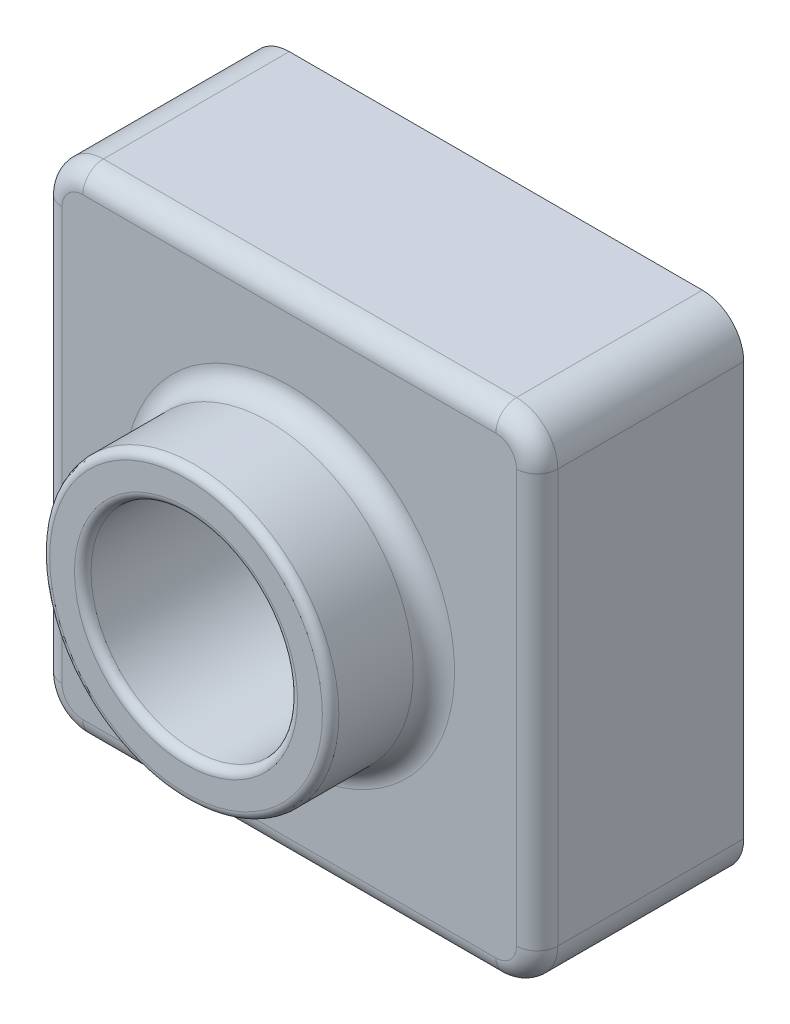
ISO-10303-21;
HEADER;
FILE_DESCRIPTION(('STEP AP214'),'2;1');
FILE_NAME('part.step','',(''),(''),'','','');
FILE_SCHEMA(('AUTOMOTIVE_DESIGN { 1 0 10303 214 1 1 1 1 }'));
ENDSEC;
DATA;
#1=APPLICATION_CONTEXT('core data for automotive mechanical design processes');
#2=APPLICATION_PROTOCOL_DEFINITION('international standard','automotive_design',2000,#1);
#3=PRODUCT_CONTEXT('',#1,'mechanical');
#4=PRODUCT('Part','Part','',(#3));
#5=PRODUCT_RELATED_PRODUCT_CATEGORY('part','',(#4));
#6=PRODUCT_DEFINITION_FORMATION('','',#4);
#7=PRODUCT_DEFINITION_CONTEXT('part definition',#1,'design');
#8=PRODUCT_DEFINITION('design','',#6,#7);
#9=PRODUCT_DEFINITION_SHAPE('','',#8);
#10=(LENGTH_UNIT() NAMED_UNIT(*) SI_UNIT(.MILLI.,.METRE.));
#11=(NAMED_UNIT(*) PLANE_ANGLE_UNIT() SI_UNIT($,.RADIAN.));
#12=(NAMED_UNIT(*) SI_UNIT($,.STERADIAN.) SOLID_ANGLE_UNIT());
#13=UNCERTAINTY_MEASURE_WITH_UNIT(LENGTH_MEASURE(1.E-05),#10,'distance_accuracy_value','');
#14=(GEOMETRIC_REPRESENTATION_CONTEXT(3) GLOBAL_UNCERTAINTY_ASSIGNED_CONTEXT((#13)) GLOBAL_UNIT_ASSIGNED_CONTEXT((#10,
#11,#12)) REPRESENTATION_CONTEXT('',''));
#15=CARTESIAN_POINT('',(0.,0.,0.));
#16=DIRECTION('',(0.,0.,1.));
#17=DIRECTION('',(1.,0.,0.));
#18=AXIS2_PLACEMENT_3D('',#15,#16,#17);
#19=CARTESIAN_POINT('',(0.,120.,0.));
#20=DIRECTION('',(0.,0.,-1.));
#21=DIRECTION('',(-1.,0.,0.));
#22=AXIS2_PLACEMENT_3D('',#19,#20,#21);
#23=PLANE('',#22);
#24=DIRECTION('',(-1.,0.,0.));
#25=VECTOR('',#24,1.);
#26=CARTESIAN_POINT('',(0.,120.,0.));
#27=LINE('',#26,#25);
#28=CARTESIAN_POINT('',(110.,120.,0.));
#29=VERTEX_POINT('',#28);
#30=CARTESIAN_POINT('',(9.99999999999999,120.,0.));
#31=VERTEX_POINT('',#30);
#32=EDGE_CURVE('E336',#29,#31,#27,.T.);
#33=ORIENTED_EDGE('',*,*,#32,.F.);
#34=CARTESIAN_POINT('',(110.,110.,0.));
#35=DIRECTION('',(0.,0.,-1.));
#36=DIRECTION('',(-1.,0.,0.));
#37=AXIS2_PLACEMENT_3D('',#34,#35,#36);
#38=CIRCLE('',#37,10.);
#39=CARTESIAN_POINT('',(120.,110.,0.));
#40=VERTEX_POINT('',#39);
#41=EDGE_CURVE('E350',#29,#40,#38,.T.);
#42=ORIENTED_EDGE('',*,*,#41,.T.);
#43=DIRECTION('',(0.,1.,0.));
#44=VECTOR('',#43,1.);
#45=CARTESIAN_POINT('',(120.,0.,0.));
#46=LINE('',#45,#44);
#47=CARTESIAN_POINT('',(120.,10.,0.));
#48=VERTEX_POINT('',#47);
#49=EDGE_CURVE('E333',#48,#40,#46,.T.);
#50=ORIENTED_EDGE('',*,*,#49,.F.);
#51=CARTESIAN_POINT('',(110.,10.,0.));
#52=DIRECTION('',(0.,0.,-1.));
#53=DIRECTION('',(-1.,0.,0.));
#54=AXIS2_PLACEMENT_3D('',#51,#52,#53);
#55=CIRCLE('',#54,10.);
#56=CARTESIAN_POINT('',(110.,0.,0.));
#57=VERTEX_POINT('',#56);
#58=EDGE_CURVE('E348',#48,#57,#55,.T.);
#59=ORIENTED_EDGE('',*,*,#58,.T.);
#60=DIRECTION('',(1.,0.,0.));
#61=VECTOR('',#60,1.);
#62=CARTESIAN_POINT('',(0.,0.,0.));
#63=LINE('',#62,#61);
#64=CARTESIAN_POINT('',(10.,0.,0.));
#65=VERTEX_POINT('',#64);
#66=EDGE_CURVE('E330',#65,#57,#63,.T.);
#67=ORIENTED_EDGE('',*,*,#66,.F.);
#68=CARTESIAN_POINT('',(10.,10.,0.));
#69=DIRECTION('',(0.,0.,-1.));
#70=DIRECTION('',(-1.,0.,0.));
#71=AXIS2_PLACEMENT_3D('',#68,#69,#70);
#72=CIRCLE('',#71,10.);
#73=CARTESIAN_POINT('',(0.,10.,0.));
#74=VERTEX_POINT('',#73);
#75=EDGE_CURVE('E346',#65,#74,#72,.T.);
#76=ORIENTED_EDGE('',*,*,#75,.T.);
#77=DIRECTION('',(0.,-1.,0.));
#78=VECTOR('',#77,1.);
#79=CARTESIAN_POINT('',(0.,0.,0.));
#80=LINE('',#79,#78);
#81=CARTESIAN_POINT('',(0.,110.,0.));
#82=VERTEX_POINT('',#81);
#83=EDGE_CURVE('E326',#82,#74,#80,.T.);
#84=ORIENTED_EDGE('',*,*,#83,.F.);
#85=CARTESIAN_POINT('',(9.99999999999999,110.,0.));
#86=DIRECTION('',(0.,0.,-1.));
#87=DIRECTION('',(-1.,0.,0.));
#88=AXIS2_PLACEMENT_3D('',#85,#86,#87);
#89=CIRCLE('',#88,10.);
#90=EDGE_CURVE('E344',#82,#31,#89,.T.);
#91=ORIENTED_EDGE('',*,*,#90,.T.);
#92=EDGE_LOOP('',(#33,#42,#50,#59,#67,#76,#84,#91));
#93=FACE_BOUND('',#92,.T.);
#94=CARTESIAN_POINT('',(110.,110.,0.));
#95=DIRECTION('',(0.,0.,-1.));
#96=DIRECTION('',(-1.,0.,0.));
#97=AXIS2_PLACEMENT_3D('',#94,#95,#96);
#98=CIRCLE('',#97,8.);
#99=CARTESIAN_POINT('',(110.,118.,0.));
#100=VERTEX_POINT('',#99);
#101=CARTESIAN_POINT('',(118.,110.,0.));
#102=VERTEX_POINT('',#101);
#103=EDGE_CURVE('E282',#100,#102,#98,.T.);
#104=ORIENTED_EDGE('',*,*,#103,.F.);
#105=DIRECTION('',(-1.,0.,0.));
#106=VECTOR('',#105,1.);
#107=CARTESIAN_POINT('',(0.,118.,0.));
#108=LINE('',#107,#106);
#109=CARTESIAN_POINT('',(9.99999999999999,118.,0.));
#110=VERTEX_POINT('',#109);
#111=EDGE_CURVE('E295',#100,#110,#108,.T.);
#112=ORIENTED_EDGE('',*,*,#111,.T.);
#113=CARTESIAN_POINT('',(9.99999999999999,110.,0.));
#114=DIRECTION('',(0.,0.,-1.));
#115=DIRECTION('',(-1.,0.,0.));
#116=AXIS2_PLACEMENT_3D('',#113,#114,#115);
#117=CIRCLE('',#116,8.);
#118=CARTESIAN_POINT('',(1.99999999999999,110.,0.));
#119=VERTEX_POINT('',#118);
#120=EDGE_CURVE('E290',#119,#110,#117,.T.);
#121=ORIENTED_EDGE('',*,*,#120,.F.);
#122=DIRECTION('',(0.,-1.,0.));
#123=VECTOR('',#122,1.);
#124=CARTESIAN_POINT('',(1.99999999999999,120.,0.));
#125=LINE('',#124,#123);
#126=CARTESIAN_POINT('',(2.,10.,0.));
#127=VERTEX_POINT('',#126);
#128=EDGE_CURVE('E49',#119,#127,#125,.T.);
#129=ORIENTED_EDGE('',*,*,#128,.T.);
#130=CARTESIAN_POINT('',(10.,10.,0.));
#131=DIRECTION('',(0.,0.,-1.));
#132=DIRECTION('',(-1.,0.,0.));
#133=AXIS2_PLACEMENT_3D('',#130,#131,#132);
#134=CIRCLE('',#133,8.);
#135=CARTESIAN_POINT('',(10.,2.,0.));
#136=VERTEX_POINT('',#135);
#137=EDGE_CURVE('E311',#136,#127,#134,.T.);
#138=ORIENTED_EDGE('',*,*,#137,.F.);
#139=DIRECTION('',(1.,0.,0.));
#140=VECTOR('',#139,1.);
#141=CARTESIAN_POINT('',(0.,2.,0.));
#142=LINE('',#141,#140);
#143=CARTESIAN_POINT('',(110.,2.,0.));
#144=VERTEX_POINT('',#143);
#145=EDGE_CURVE('E309',#136,#144,#142,.T.);
#146=ORIENTED_EDGE('',*,*,#145,.T.);
#147=CARTESIAN_POINT('',(110.,10.,0.));
#148=DIRECTION('',(0.,0.,-1.));
#149=DIRECTION('',(-1.,0.,0.));
#150=AXIS2_PLACEMENT_3D('',#147,#148,#149);
#151=CIRCLE('',#150,8.);
#152=CARTESIAN_POINT('',(118.,10.,0.));
#153=VERTEX_POINT('',#152);
#154=EDGE_CURVE('E316',#153,#144,#151,.T.);
#155=ORIENTED_EDGE('',*,*,#154,.F.);
#156=DIRECTION('',(0.,1.,0.));
#157=VECTOR('',#156,1.);
#158=CARTESIAN_POINT('',(118.,120.,0.));
#159=LINE('',#158,#157);
#160=EDGE_CURVE('E314',#153,#102,#159,.T.);
#161=ORIENTED_EDGE('',*,*,#160,.T.);
#162=EDGE_LOOP('',(#104,#112,#121,#129,#138,#146,#155,#161));
#163=FACE_BOUND('',#162,.T.);
#164=ADVANCED_FACE('F34',(#93,#163),#23,.T.);
#165=CARTESIAN_POINT('',(0.,120.,50.));
#166=DIRECTION('',(0.,0.,-1.));
#167=DIRECTION('',(-1.,0.,0.));
#168=AXIS2_PLACEMENT_3D('',#165,#166,#167);
#169=PLANE('',#168);
#170=CARTESIAN_POINT('',(60.,60.,50.));
#171=DIRECTION('',(0.,0.,-1.));
#172=DIRECTION('',(-1.,0.,0.));
#173=AXIS2_PLACEMENT_3D('',#170,#171,#172);
#174=CIRCLE('',#173,40.);
#175=CARTESIAN_POINT('',(20.,60.,50.));
#176=VERTEX_POINT('',#175);
#177=EDGE_CURVE('E386',#176,#176,#174,.T.);
#178=ORIENTED_EDGE('',*,*,#177,.T.);
#179=EDGE_LOOP('',(#178));
#180=FACE_BOUND('',#179,.T.);
#181=DIRECTION('',(1.,0.,0.));
#182=VECTOR('',#181,1.);
#183=CARTESIAN_POINT('',(0.,5.,50.));
#184=LINE('',#183,#182);
#185=CARTESIAN_POINT('',(10.,5.,50.));
#186=VERTEX_POINT('',#185);
#187=CARTESIAN_POINT('',(110.,5.,50.));
#188=VERTEX_POINT('',#187);
#189=EDGE_CURVE('E381',#186,#188,#184,.T.);
#190=ORIENTED_EDGE('',*,*,#189,.T.);
#191=CARTESIAN_POINT('',(110.,10.,50.));
#192=DIRECTION('',(0.,0.,-1.));
#193=DIRECTION('',(-1.,0.,0.));
#194=AXIS2_PLACEMENT_3D('',#191,#192,#193);
#195=CIRCLE('',#194,5.);
#196=CARTESIAN_POINT('',(115.,10.,50.));
#197=VERTEX_POINT('',#196);
#198=EDGE_CURVE('E383',#188,#197,#195,.F.);
#199=ORIENTED_EDGE('',*,*,#198,.T.);
#200=DIRECTION('',(0.,1.,0.));
#201=VECTOR('',#200,1.);
#202=CARTESIAN_POINT('',(115.,120.,50.));
#203=LINE('',#202,#201);
#204=CARTESIAN_POINT('',(115.,110.,50.));
#205=VERTEX_POINT('',#204);
#206=EDGE_CURVE('E369',#197,#205,#203,.T.);
#207=ORIENTED_EDGE('',*,*,#206,.T.);
#208=CARTESIAN_POINT('',(110.,110.,50.));
#209=DIRECTION('',(0.,0.,-1.));
#210=DIRECTION('',(-1.,0.,0.));
#211=AXIS2_PLACEMENT_3D('',#208,#209,#210);
#212=CIRCLE('',#211,5.);
#213=CARTESIAN_POINT('',(110.,115.,50.));
#214=VERTEX_POINT('',#213);
#215=EDGE_CURVE('E371',#205,#214,#212,.F.);
#216=ORIENTED_EDGE('',*,*,#215,.T.);
#217=DIRECTION('',(-1.,0.,0.));
#218=VECTOR('',#217,1.);
#219=CARTESIAN_POINT('',(0.,115.,50.));
#220=LINE('',#219,#218);
#221=CARTESIAN_POINT('',(9.99999999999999,115.,50.));
#222=VERTEX_POINT('',#221);
#223=EDGE_CURVE('E373',#214,#222,#220,.T.);
#224=ORIENTED_EDGE('',*,*,#223,.T.);
#225=CARTESIAN_POINT('',(9.99999999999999,110.,50.));
#226=DIRECTION('',(0.,0.,-1.));
#227=DIRECTION('',(-1.,0.,0.));
#228=AXIS2_PLACEMENT_3D('',#225,#226,#227);
#229=CIRCLE('',#228,5.);
#230=CARTESIAN_POINT('',(4.99999999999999,110.,50.));
#231=VERTEX_POINT('',#230);
#232=EDGE_CURVE('E375',#222,#231,#229,.F.);
#233=ORIENTED_EDGE('',*,*,#232,.T.);
#234=DIRECTION('',(0.,-1.,0.));
#235=VECTOR('',#234,1.);
#236=CARTESIAN_POINT('',(4.99999999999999,120.,50.));
#237=LINE('',#236,#235);
#238=CARTESIAN_POINT('',(5.,10.,50.));
#239=VERTEX_POINT('',#238);
#240=EDGE_CURVE('E377',#231,#239,#237,.T.);
#241=ORIENTED_EDGE('',*,*,#240,.T.);
#242=CARTESIAN_POINT('',(10.,10.,50.));
#243=DIRECTION('',(0.,0.,-1.));
#244=DIRECTION('',(-1.,0.,0.));
#245=AXIS2_PLACEMENT_3D('',#242,#243,#244);
#246=CIRCLE('',#245,5.);
#247=EDGE_CURVE('E379',#239,#186,#246,.F.);
#248=ORIENTED_EDGE('',*,*,#247,.T.);
#249=EDGE_LOOP('',(#190,#199,#207,#216,#224,#233,#241,#248));
#250=FACE_BOUND('',#249,.T.);
#251=ADVANCED_FACE('F475',(#180,#250),#169,.F.);
#252=CARTESIAN_POINT('',(0.,0.,50.));
#253=DIRECTION('',(1.,0.,0.));
#254=DIRECTION('',(0.,1.,0.));
#255=AXIS2_PLACEMENT_3D('',#252,#253,#254);
#256=PLANE('',#255);
#257=DIRECTION('',(0.,0.,-1.));
#258=VECTOR('',#257,1.);
#259=CARTESIAN_POINT('',(0.,10.,50.));
#260=LINE('',#259,#258);
#261=CARTESIAN_POINT('',(0.,10.,45.));
#262=VERTEX_POINT('',#261);
#263=EDGE_CURVE('E363',#74,#262,#260,.F.);
#264=ORIENTED_EDGE('',*,*,#263,.T.);
#265=DIRECTION('',(0.,-1.,0.));
#266=VECTOR('',#265,1.);
#267=CARTESIAN_POINT('',(0.,0.,45.));
#268=LINE('',#267,#266);
#269=CARTESIAN_POINT('',(0.,110.,45.));
#270=VERTEX_POINT('',#269);
#271=EDGE_CURVE('E396',#262,#270,#268,.F.);
#272=ORIENTED_EDGE('',*,*,#271,.T.);
#273=DIRECTION('',(0.,0.,-1.));
#274=VECTOR('',#273,1.);
#275=CARTESIAN_POINT('',(0.,110.,50.));
#276=LINE('',#275,#274);
#277=EDGE_CURVE('E361',#270,#82,#276,.T.);
#278=ORIENTED_EDGE('',*,*,#277,.T.);
#279=ORIENTED_EDGE('',*,*,#83,.T.);
#280=EDGE_LOOP('',(#264,#272,#278,#279));
#281=FACE_BOUND('',#280,.T.);
#282=ADVANCED_FACE('F480',(#281),#256,.F.);
#283=CARTESIAN_POINT('',(0.,0.,50.));
#284=DIRECTION('',(0.,1.,0.));
#285=DIRECTION('',(0.,0.,1.));
#286=AXIS2_PLACEMENT_3D('',#283,#284,#285);
#287=PLANE('',#286);
#288=DIRECTION('',(0.,0.,-1.));
#289=VECTOR('',#288,1.);
#290=CARTESIAN_POINT('',(110.,0.,50.));
#291=LINE('',#290,#289);
#292=CARTESIAN_POINT('',(110.,0.,45.));
#293=VERTEX_POINT('',#292);
#294=EDGE_CURVE('E358',#57,#293,#291,.F.);
#295=ORIENTED_EDGE('',*,*,#294,.T.);
#296=DIRECTION('',(1.,0.,0.));
#297=VECTOR('',#296,1.);
#298=CARTESIAN_POINT('',(0.,0.,45.));
#299=LINE('',#298,#297);
#300=CARTESIAN_POINT('',(10.,0.,45.));
#301=VERTEX_POINT('',#300);
#302=EDGE_CURVE('E392',#293,#301,#299,.F.);
#303=ORIENTED_EDGE('',*,*,#302,.T.);
#304=DIRECTION('',(0.,0.,-1.));
#305=VECTOR('',#304,1.);
#306=CARTESIAN_POINT('',(10.,0.,50.));
#307=LINE('',#306,#305);
#308=EDGE_CURVE('E356',#301,#65,#307,.T.);
#309=ORIENTED_EDGE('',*,*,#308,.T.);
#310=ORIENTED_EDGE('',*,*,#66,.T.);
#311=EDGE_LOOP('',(#295,#303,#309,#310));
#312=FACE_BOUND('',#311,.T.);
#313=ADVANCED_FACE('F884',(#312),#287,.F.);
#314=CARTESIAN_POINT('',(120.,0.,50.));
#315=DIRECTION('',(-1.,0.,0.));
#316=DIRECTION('',(0.,-1.,0.));
#317=AXIS2_PLACEMENT_3D('',#314,#315,#316);
#318=PLANE('',#317);
#319=DIRECTION('',(0.,0.,-1.));
#320=VECTOR('',#319,1.);
#321=CARTESIAN_POINT('',(120.,110.,50.));
#322=LINE('',#321,#320);
#323=CARTESIAN_POINT('',(120.,110.,45.));
#324=VERTEX_POINT('',#323);
#325=EDGE_CURVE('E354',#40,#324,#322,.F.);
#326=ORIENTED_EDGE('',*,*,#325,.T.);
#327=DIRECTION('',(0.,1.,0.));
#328=VECTOR('',#327,1.);
#329=CARTESIAN_POINT('',(120.,0.,45.));
#330=LINE('',#329,#328);
#331=CARTESIAN_POINT('',(120.,10.,45.));
#332=VERTEX_POINT('',#331);
#333=EDGE_CURVE('E403',#324,#332,#330,.F.);
#334=ORIENTED_EDGE('',*,*,#333,.T.);
#335=DIRECTION('',(0.,0.,-1.));
#336=VECTOR('',#335,1.);
#337=CARTESIAN_POINT('',(120.,10.,50.));
#338=LINE('',#337,#336);
#339=EDGE_CURVE('E352',#332,#48,#338,.T.);
#340=ORIENTED_EDGE('',*,*,#339,.T.);
#341=ORIENTED_EDGE('',*,*,#49,.T.);
#342=EDGE_LOOP('',(#326,#334,#340,#341));
#343=FACE_BOUND('',#342,.T.);
#344=ADVANCED_FACE('F469',(#343),#318,.F.);
#345=CARTESIAN_POINT('',(0.,120.,50.));
#346=DIRECTION('',(0.,-1.,0.));
#347=DIRECTION('',(0.,0.,-1.));
#348=AXIS2_PLACEMENT_3D('',#345,#346,#347);
#349=PLANE('',#348);
#350=DIRECTION('',(0.,0.,-1.));
#351=VECTOR('',#350,1.);
#352=CARTESIAN_POINT('',(9.99999999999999,120.,50.));
#353=LINE('',#352,#351);
#354=CARTESIAN_POINT('',(9.99999999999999,120.,45.));
#355=VERTEX_POINT('',#354);
#356=EDGE_CURVE('E339',#31,#355,#353,.F.);
#357=ORIENTED_EDGE('',*,*,#356,.T.);
#358=DIRECTION('',(-1.,0.,0.));
#359=VECTOR('',#358,1.);
#360=CARTESIAN_POINT('',(0.,120.,45.));
#361=LINE('',#360,#359);
#362=CARTESIAN_POINT('',(110.,120.,45.));
#363=VERTEX_POINT('',#362);
#364=EDGE_CURVE('E400',#355,#363,#361,.F.);
#365=ORIENTED_EDGE('',*,*,#364,.T.);
#366=DIRECTION('',(0.,0.,-1.));
#367=VECTOR('',#366,1.);
#368=CARTESIAN_POINT('',(110.,120.,50.));
#369=LINE('',#368,#367);
#370=EDGE_CURVE('E342',#363,#29,#369,.T.);
#371=ORIENTED_EDGE('',*,*,#370,.T.);
#372=ORIENTED_EDGE('',*,*,#32,.T.);
#373=EDGE_LOOP('',(#357,#365,#371,#372));
#374=FACE_BOUND('',#373,.T.);
#375=ADVANCED_FACE('F461',(#374),#349,.F.);
#376=CARTESIAN_POINT('',(60.,60.,0.));
#377=DIRECTION('',(0.,0.,-1.));
#378=DIRECTION('',(-1.,0.,0.));
#379=AXIS2_PLACEMENT_3D('',#376,#377,#378);
#380=CIRCLE('',#379,27.);
#381=CARTESIAN_POINT('',(33.,60.,0.));
#382=VERTEX_POINT('',#381);
#383=EDGE_CURVE('E265',#382,#382,#380,.F.);
#384=ORIENTED_EDGE('',*,*,#383,.F.);
#385=EDGE_LOOP('',(#384));
#386=FACE_BOUND('',#385,.T.);
#387=CARTESIAN_POINT('',(60.,60.,0.));
#388=DIRECTION('',(0.,0.,1.));
#389=DIRECTION('',(1.,0.,0.));
#390=AXIS2_PLACEMENT_3D('',#387,#388,#389);
#391=CIRCLE('',#390,25.);
#392=CARTESIAN_POINT('',(85.,60.,0.));
#393=VERTEX_POINT('',#392);
#394=EDGE_CURVE('E323',#393,#393,#391,.T.);
#395=ORIENTED_EDGE('',*,*,#394,.T.);
#396=EDGE_LOOP('',(#395));
#397=FACE_BOUND('',#396,.T.);
#398=ADVANCED_FACE('F459',(#386,#397),#23,.T.);
#399=CARTESIAN_POINT('',(60.,60.,75.));
#400=DIRECTION('',(0.,0.,-1.));
#401=DIRECTION('',(-1.,0.,0.));
#402=AXIS2_PLACEMENT_3D('',#399,#400,#401);
#403=CYLINDRICAL_SURFACE('',#402,35.);
#404=CARTESIAN_POINT('',(60.,60.,73.));
#405=DIRECTION('',(0.,0.,1.));
#406=DIRECTION('',(1.,0.,0.));
#407=AXIS2_PLACEMENT_3D('',#404,#405,#406);
#408=CIRCLE('',#407,35.);
#409=CARTESIAN_POINT('',(95.,60.,73.));
#410=VERTEX_POINT('',#409);
#411=EDGE_CURVE('E42',#410,#410,#408,.F.);
#412=ORIENTED_EDGE('',*,*,#411,.T.);
#413=EDGE_LOOP('',(#412));
#414=FACE_BOUND('',#413,.T.);
#415=CARTESIAN_POINT('',(60.,60.,55.));
#416=DIRECTION('',(0.,0.,-1.));
#417=DIRECTION('',(-1.,0.,0.));
#418=AXIS2_PLACEMENT_3D('',#415,#416,#417);
#419=CIRCLE('',#418,35.);
#420=CARTESIAN_POINT('',(25.,60.,55.));
#421=VERTEX_POINT('',#420);
#422=EDGE_CURVE('E366',#421,#421,#419,.F.);
#423=ORIENTED_EDGE('',*,*,#422,.T.);
#424=EDGE_LOOP('',(#423));
#425=FACE_BOUND('',#424,.T.);
#426=ADVANCED_FACE('F433',(#414,#425),#403,.T.);
#427=CARTESIAN_POINT('',(60.,60.,75.));
#428=DIRECTION('',(0.,0.,1.));
#429=DIRECTION('',(1.,0.,0.));
#430=AXIS2_PLACEMENT_3D('',#427,#428,#429);
#431=PLANE('',#430);
#432=CARTESIAN_POINT('',(60.,60.,75.));
#433=DIRECTION('',(0.,0.,1.));
#434=DIRECTION('',(1.,0.,0.));
#435=AXIS2_PLACEMENT_3D('',#432,#433,#434);
#436=CIRCLE('',#435,33.);
#437=CARTESIAN_POINT('',(93.,60.,75.));
#438=VERTEX_POINT('',#437);
#439=EDGE_CURVE('E428',#438,#438,#436,.T.);
#440=ORIENTED_EDGE('',*,*,#439,.T.);
#441=EDGE_LOOP('',(#440));
#442=FACE_BOUND('',#441,.T.);
#443=CARTESIAN_POINT('',(60.,60.,75.));
#444=DIRECTION('',(0.,0.,1.));
#445=DIRECTION('',(1.,0.,0.));
#446=AXIS2_PLACEMENT_3D('',#443,#444,#445);
#447=CIRCLE('',#446,27.);
#448=CARTESIAN_POINT('',(87.,60.,75.));
#449=VERTEX_POINT('',#448);
#450=EDGE_CURVE('E405',#449,#449,#447,.F.);
#451=ORIENTED_EDGE('',*,*,#450,.T.);
#452=EDGE_LOOP('',(#451));
#453=FACE_BOUND('',#452,.T.);
#454=ADVANCED_FACE('F442',(#442,#453),#431,.T.);
#455=CARTESIAN_POINT('',(60.,60.,0.));
#456=DIRECTION('',(0.,0.,1.));
#457=DIRECTION('',(1.,0.,0.));
#458=AXIS2_PLACEMENT_3D('',#455,#456,#457);
#459=CYLINDRICAL_SURFACE('',#458,25.);
#460=CARTESIAN_POINT('',(60.,60.,73.));
#461=DIRECTION('',(0.,0.,1.));
#462=DIRECTION('',(1.,0.,0.));
#463=AXIS2_PLACEMENT_3D('',#460,#461,#462);
#464=CIRCLE('',#463,25.);
#465=CARTESIAN_POINT('',(85.,60.,73.));
#466=VERTEX_POINT('',#465);
#467=EDGE_CURVE('E11',#466,#466,#464,.T.);
#468=ORIENTED_EDGE('',*,*,#467,.T.);
#469=EDGE_LOOP('',(#468));
#470=FACE_BOUND('',#469,.T.);
#471=ORIENTED_EDGE('',*,*,#394,.F.);
#472=EDGE_LOOP('',(#471));
#473=FACE_BOUND('',#472,.T.);
#474=ADVANCED_FACE('F445',(#470,#473),#459,.F.);
#475=CARTESIAN_POINT('',(110.,110.,50.));
#476=DIRECTION('',(0.,0.,-1.));
#477=DIRECTION('',(-1.,0.,0.));
#478=AXIS2_PLACEMENT_3D('',#475,#476,#477);
#479=CYLINDRICAL_SURFACE('',#478,10.);
#480=ORIENTED_EDGE('',*,*,#370,.F.);
#481=CARTESIAN_POINT('',(110.,110.,45.));
#482=DIRECTION('',(0.,0.,-1.));
#483=DIRECTION('',(-1.,0.,0.));
#484=AXIS2_PLACEMENT_3D('',#481,#482,#483);
#485=CIRCLE('',#484,10.);
#486=EDGE_CURVE('E57',#363,#324,#485,.T.);
#487=ORIENTED_EDGE('',*,*,#486,.T.);
#488=ORIENTED_EDGE('',*,*,#325,.F.);
#489=ORIENTED_EDGE('',*,*,#41,.F.);
#490=EDGE_LOOP('',(#480,#487,#488,#489));
#491=FACE_BOUND('',#490,.T.);
#492=ADVANCED_FACE('F455',(#491),#479,.T.);
#493=CARTESIAN_POINT('',(110.,10.,50.));
#494=DIRECTION('',(0.,0.,-1.));
#495=DIRECTION('',(-1.,0.,0.));
#496=AXIS2_PLACEMENT_3D('',#493,#494,#495);
#497=CYLINDRICAL_SURFACE('',#496,10.);
#498=ORIENTED_EDGE('',*,*,#339,.F.);
#499=CARTESIAN_POINT('',(110.,10.,45.));
#500=DIRECTION('',(0.,0.,-1.));
#501=DIRECTION('',(-1.,0.,0.));
#502=AXIS2_PLACEMENT_3D('',#499,#500,#501);
#503=CIRCLE('',#502,10.);
#504=EDGE_CURVE('E389',#332,#293,#503,.T.);
#505=ORIENTED_EDGE('',*,*,#504,.T.);
#506=ORIENTED_EDGE('',*,*,#294,.F.);
#507=ORIENTED_EDGE('',*,*,#58,.F.);
#508=EDGE_LOOP('',(#498,#505,#506,#507));
#509=FACE_BOUND('',#508,.T.);
#510=ADVANCED_FACE('F854',(#509),#497,.T.);
#511=CARTESIAN_POINT('',(10.,10.,50.));
#512=DIRECTION('',(0.,0.,-1.));
#513=DIRECTION('',(-1.,0.,0.));
#514=AXIS2_PLACEMENT_3D('',#511,#512,#513);
#515=CYLINDRICAL_SURFACE('',#514,10.);
#516=ORIENTED_EDGE('',*,*,#308,.F.);
#517=CARTESIAN_POINT('',(10.,10.,45.));
#518=DIRECTION('',(0.,0.,-1.));
#519=DIRECTION('',(-1.,0.,0.));
#520=AXIS2_PLACEMENT_3D('',#517,#518,#519);
#521=CIRCLE('',#520,10.);
#522=EDGE_CURVE('E394',#301,#262,#521,.T.);
#523=ORIENTED_EDGE('',*,*,#522,.T.);
#524=ORIENTED_EDGE('',*,*,#263,.F.);
#525=ORIENTED_EDGE('',*,*,#75,.F.);
#526=EDGE_LOOP('',(#516,#523,#524,#525));
#527=FACE_BOUND('',#526,.T.);
#528=ADVANCED_FACE('F844',(#527),#515,.T.);
#529=CARTESIAN_POINT('',(9.99999999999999,110.,50.));
#530=DIRECTION('',(0.,0.,-1.));
#531=DIRECTION('',(-1.,0.,0.));
#532=AXIS2_PLACEMENT_3D('',#529,#530,#531);
#533=CYLINDRICAL_SURFACE('',#532,10.);
#534=ORIENTED_EDGE('',*,*,#277,.F.);
#535=CARTESIAN_POINT('',(9.99999999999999,110.,45.));
#536=DIRECTION('',(0.,0.,-1.));
#537=DIRECTION('',(-1.,0.,0.));
#538=AXIS2_PLACEMENT_3D('',#535,#536,#537);
#539=CIRCLE('',#538,10.);
#540=EDGE_CURVE('E398',#270,#355,#539,.T.);
#541=ORIENTED_EDGE('',*,*,#540,.T.);
#542=ORIENTED_EDGE('',*,*,#356,.F.);
#543=ORIENTED_EDGE('',*,*,#90,.F.);
#544=EDGE_LOOP('',(#534,#541,#542,#543));
#545=FACE_BOUND('',#544,.T.);
#546=ADVANCED_FACE('F834',(#545),#533,.T.);
#547=CARTESIAN_POINT('',(60.,60.,55.));
#548=DIRECTION('',(0.,0.,-1.));
#549=DIRECTION('',(-1.,0.,0.));
#550=AXIS2_PLACEMENT_3D('',#547,#548,#549);
#551=TOROIDAL_SURFACE('',#550,40.,5.);
#552=ORIENTED_EDGE('',*,*,#177,.F.);
#553=EDGE_LOOP('',(#552));
#554=FACE_BOUND('',#553,.T.);
#555=ORIENTED_EDGE('',*,*,#422,.F.);
#556=EDGE_LOOP('',(#555));
#557=FACE_BOUND('',#556,.T.);
#558=ADVANCED_FACE('F823',(#554,#557),#551,.F.);
#559=CARTESIAN_POINT('',(9.99999999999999,110.,45.));
#560=DIRECTION('',(0.,0.,-1.));
#561=DIRECTION('',(-1.,0.,0.));
#562=AXIS2_PLACEMENT_3D('',#559,#560,#561);
#563=DEGENERATE_TOROIDAL_SURFACE('',#562,5.,5.,.T.);
#564=CARTESIAN_POINT('',(9.99999999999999,115.,45.));
#565=DIRECTION('',(1.,0.,0.));
#566=DIRECTION('',(0.,0.,-1.));
#567=AXIS2_PLACEMENT_3D('',#564,#565,#566);
#568=CIRCLE('',#567,5.);
#569=EDGE_CURVE('E421',#355,#222,#568,.T.);
#570=ORIENTED_EDGE('',*,*,#569,.F.);
#571=ORIENTED_EDGE('',*,*,#540,.F.);
#572=CARTESIAN_POINT('',(4.99999999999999,110.,45.));
#573=DIRECTION('',(0.,-1.,0.));
#574=DIRECTION('',(0.,0.,-1.));
#575=AXIS2_PLACEMENT_3D('',#572,#573,#574);
#576=CIRCLE('',#575,5.);
#577=EDGE_CURVE('E327',#231,#270,#576,.T.);
#578=ORIENTED_EDGE('',*,*,#577,.F.);
#579=ORIENTED_EDGE('',*,*,#232,.F.);
#580=EDGE_LOOP('',(#570,#571,#578,#579));
#581=FACE_BOUND('',#580,.T.);
#582=ADVANCED_FACE('F813',(#581),#563,.T.);
#583=CARTESIAN_POINT('',(4.99999999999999,120.,45.));
#584=DIRECTION('',(0.,-1.,0.));
#585=DIRECTION('',(1.,0.,0.));
#586=AXIS2_PLACEMENT_3D('',#583,#584,#585);
#587=CYLINDRICAL_SURFACE('',#586,5.);
#588=ORIENTED_EDGE('',*,*,#577,.T.);
#589=ORIENTED_EDGE('',*,*,#271,.F.);
#590=CARTESIAN_POINT('',(5.,10.,45.));
#591=DIRECTION('',(0.,-1.,0.));
#592=DIRECTION('',(0.,0.,-1.));
#593=AXIS2_PLACEMENT_3D('',#590,#591,#592);
#594=CIRCLE('',#593,5.);
#595=EDGE_CURVE('E418',#239,#262,#594,.T.);
#596=ORIENTED_EDGE('',*,*,#595,.F.);
#597=ORIENTED_EDGE('',*,*,#240,.F.);
#598=EDGE_LOOP('',(#588,#589,#596,#597));
#599=FACE_BOUND('',#598,.T.);
#600=ADVANCED_FACE('F803',(#599),#587,.T.);
#601=CARTESIAN_POINT('',(0.,115.,45.));
#602=DIRECTION('',(-1.,0.,0.));
#603=DIRECTION('',(0.,0.,1.));
#604=AXIS2_PLACEMENT_3D('',#601,#602,#603);
#605=CYLINDRICAL_SURFACE('',#604,5.);
#606=ORIENTED_EDGE('',*,*,#569,.T.);
#607=ORIENTED_EDGE('',*,*,#223,.F.);
#608=CARTESIAN_POINT('',(110.,115.,45.));
#609=DIRECTION('',(1.,0.,0.));
#610=DIRECTION('',(0.,0.,-1.));
#611=AXIS2_PLACEMENT_3D('',#608,#609,#610);
#612=CIRCLE('',#611,5.);
#613=EDGE_CURVE('E415',#363,#214,#612,.T.);
#614=ORIENTED_EDGE('',*,*,#613,.F.);
#615=ORIENTED_EDGE('',*,*,#364,.F.);
#616=EDGE_LOOP('',(#606,#607,#614,#615));
#617=FACE_BOUND('',#616,.T.);
#618=ADVANCED_FACE('F792',(#617),#605,.T.);
#619=CARTESIAN_POINT('',(10.,10.,45.));
#620=DIRECTION('',(0.,0.,-1.));
#621=DIRECTION('',(-1.,0.,0.));
#622=AXIS2_PLACEMENT_3D('',#619,#620,#621);
#623=DEGENERATE_TOROIDAL_SURFACE('',#622,5.,5.,.T.);
#624=ORIENTED_EDGE('',*,*,#595,.T.);
#625=ORIENTED_EDGE('',*,*,#522,.F.);
#626=CARTESIAN_POINT('',(10.,5.,45.));
#627=DIRECTION('',(1.,0.,0.));
#628=DIRECTION('',(0.,0.,-1.));
#629=AXIS2_PLACEMENT_3D('',#626,#627,#628);
#630=CIRCLE('',#629,5.);
#631=EDGE_CURVE('E412',#186,#301,#630,.T.);
#632=ORIENTED_EDGE('',*,*,#631,.F.);
#633=ORIENTED_EDGE('',*,*,#247,.F.);
#634=EDGE_LOOP('',(#624,#625,#632,#633));
#635=FACE_BOUND('',#634,.T.);
#636=ADVANCED_FACE('F781',(#635),#623,.T.);
#637=CARTESIAN_POINT('',(110.,110.,45.));
#638=DIRECTION('',(0.,0.,-1.));
#639=DIRECTION('',(-1.,0.,0.));
#640=AXIS2_PLACEMENT_3D('',#637,#638,#639);
#641=DEGENERATE_TOROIDAL_SURFACE('',#640,5.,5.,.T.);
#642=ORIENTED_EDGE('',*,*,#613,.T.);
#643=ORIENTED_EDGE('',*,*,#215,.F.);
#644=CARTESIAN_POINT('',(115.,110.,45.));
#645=DIRECTION('',(0.,-1.,0.));
#646=DIRECTION('',(0.,0.,-1.));
#647=AXIS2_PLACEMENT_3D('',#644,#645,#646);
#648=CIRCLE('',#647,5.);
#649=EDGE_CURVE('E409',#324,#205,#648,.T.);
#650=ORIENTED_EDGE('',*,*,#649,.F.);
#651=ORIENTED_EDGE('',*,*,#486,.F.);
#652=EDGE_LOOP('',(#642,#643,#650,#651));
#653=FACE_BOUND('',#652,.T.);
#654=ADVANCED_FACE('F771',(#653),#641,.T.);
#655=CARTESIAN_POINT('',(0.,5.,45.));
#656=DIRECTION('',(1.,0.,0.));
#657=DIRECTION('',(0.,0.,-1.));
#658=AXIS2_PLACEMENT_3D('',#655,#656,#657);
#659=CYLINDRICAL_SURFACE('',#658,5.);
#660=ORIENTED_EDGE('',*,*,#631,.T.);
#661=ORIENTED_EDGE('',*,*,#302,.F.);
#662=CARTESIAN_POINT('',(110.,5.,45.));
#663=DIRECTION('',(1.,0.,0.));
#664=DIRECTION('',(0.,0.,-1.));
#665=AXIS2_PLACEMENT_3D('',#662,#663,#664);
#666=CIRCLE('',#665,5.);
#667=EDGE_CURVE('E407',#188,#293,#666,.T.);
#668=ORIENTED_EDGE('',*,*,#667,.F.);
#669=ORIENTED_EDGE('',*,*,#189,.F.);
#670=EDGE_LOOP('',(#660,#661,#668,#669));
#671=FACE_BOUND('',#670,.T.);
#672=ADVANCED_FACE('F761',(#671),#659,.T.);
#673=CARTESIAN_POINT('',(115.,120.,45.));
#674=DIRECTION('',(0.,1.,0.));
#675=DIRECTION('',(-1.,0.,0.));
#676=AXIS2_PLACEMENT_3D('',#673,#674,#675);
#677=CYLINDRICAL_SURFACE('',#676,5.);
#678=ORIENTED_EDGE('',*,*,#649,.T.);
#679=ORIENTED_EDGE('',*,*,#206,.F.);
#680=CARTESIAN_POINT('',(115.,10.,45.));
#681=DIRECTION('',(0.,-1.,0.));
#682=DIRECTION('',(1.,0.,0.));
#683=AXIS2_PLACEMENT_3D('',#680,#681,#682);
#684=CIRCLE('',#683,5.);
#685=EDGE_CURVE('E253',#332,#197,#684,.T.);
#686=ORIENTED_EDGE('',*,*,#685,.F.);
#687=ORIENTED_EDGE('',*,*,#333,.F.);
#688=EDGE_LOOP('',(#678,#679,#686,#687));
#689=FACE_BOUND('',#688,.T.);
#690=ADVANCED_FACE('F750',(#689),#677,.T.);
#691=CARTESIAN_POINT('',(110.,10.,45.));
#692=DIRECTION('',(0.,0.,-1.));
#693=DIRECTION('',(-1.,0.,0.));
#694=AXIS2_PLACEMENT_3D('',#691,#692,#693);
#695=DEGENERATE_TOROIDAL_SURFACE('',#694,5.,5.,.T.);
#696=ORIENTED_EDGE('',*,*,#667,.T.);
#697=ORIENTED_EDGE('',*,*,#504,.F.);
#698=ORIENTED_EDGE('',*,*,#685,.T.);
#699=ORIENTED_EDGE('',*,*,#198,.F.);
#700=EDGE_LOOP('',(#696,#697,#698,#699));
#701=FACE_BOUND('',#700,.T.);
#702=ADVANCED_FACE('F439',(#701),#695,.T.);
#703=CARTESIAN_POINT('',(60.,60.,73.));
#704=DIRECTION('',(0.,0.,1.));
#705=DIRECTION('',(1.,0.,0.));
#706=AXIS2_PLACEMENT_3D('',#703,#704,#705);
#707=TOROIDAL_SURFACE('',#706,33.,2.);
#708=ORIENTED_EDGE('',*,*,#411,.F.);
#709=EDGE_LOOP('',(#708));
#710=FACE_BOUND('',#709,.T.);
#711=ORIENTED_EDGE('',*,*,#439,.F.);
#712=EDGE_LOOP('',(#711));
#713=FACE_BOUND('',#712,.T.);
#714=ADVANCED_FACE('F436',(#710,#713),#707,.T.);
#715=CARTESIAN_POINT('',(60.,60.,73.));
#716=DIRECTION('',(0.,0.,1.));
#717=DIRECTION('',(1.,0.,0.));
#718=AXIS2_PLACEMENT_3D('',#715,#716,#717);
#719=TOROIDAL_SURFACE('',#718,27.,2.);
#720=ORIENTED_EDGE('',*,*,#450,.F.);
#721=EDGE_LOOP('',(#720));
#722=FACE_BOUND('',#721,.T.);
#723=ORIENTED_EDGE('',*,*,#467,.F.);
#724=EDGE_LOOP('',(#723));
#725=FACE_BOUND('',#724,.T.);
#726=ADVANCED_FACE('F36',(#722,#725),#719,.T.);
#727=CARTESIAN_POINT('',(0.,120.,48.));
#728=DIRECTION('',(0.,0.,-1.));
#729=DIRECTION('',(-1.,0.,0.));
#730=AXIS2_PLACEMENT_3D('',#727,#728,#729);
#731=PLANE('',#730);
#732=CARTESIAN_POINT('',(60.,60.,48.));
#733=DIRECTION('',(0.,0.,-1.));
#734=DIRECTION('',(-1.,0.,0.));
#735=AXIS2_PLACEMENT_3D('',#732,#733,#734);
#736=CIRCLE('',#735,40.);
#737=CARTESIAN_POINT('',(20.,60.,48.));
#738=VERTEX_POINT('',#737);
#739=EDGE_CURVE('E227',#738,#738,#736,.T.);
#740=ORIENTED_EDGE('',*,*,#739,.F.);
#741=EDGE_LOOP('',(#740));
#742=FACE_BOUND('',#741,.T.);
#743=DIRECTION('',(-1.,0.,0.));
#744=VECTOR('',#743,1.);
#745=CARTESIAN_POINT('',(0.,5.,48.));
#746=LINE('',#745,#744);
#747=CARTESIAN_POINT('',(10.,5.,48.));
#748=VERTEX_POINT('',#747);
#749=CARTESIAN_POINT('',(110.,5.,48.));
#750=VERTEX_POINT('',#749);
#751=EDGE_CURVE('E199',#748,#750,#746,.F.);
#752=ORIENTED_EDGE('',*,*,#751,.F.);
#753=CARTESIAN_POINT('',(10.,10.,48.));
#754=DIRECTION('',(0.,0.,-1.));
#755=DIRECTION('',(-1.,0.,0.));
#756=AXIS2_PLACEMENT_3D('',#753,#754,#755);
#757=CIRCLE('',#756,5.);
#758=CARTESIAN_POINT('',(5.,9.99999999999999,48.));
#759=VERTEX_POINT('',#758);
#760=EDGE_CURVE('E210',#759,#748,#757,.F.);
#761=ORIENTED_EDGE('',*,*,#760,.F.);
#762=DIRECTION('',(0.,1.,0.));
#763=VECTOR('',#762,1.);
#764=CARTESIAN_POINT('',(4.99999999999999,120.,48.));
#765=LINE('',#764,#763);
#766=CARTESIAN_POINT('',(4.99999999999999,110.,48.));
#767=VERTEX_POINT('',#766);
#768=EDGE_CURVE('E240',#767,#759,#765,.F.);
#769=ORIENTED_EDGE('',*,*,#768,.F.);
#770=CARTESIAN_POINT('',(9.99999999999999,110.,48.));
#771=DIRECTION('',(0.,0.,-1.));
#772=DIRECTION('',(-1.,0.,0.));
#773=AXIS2_PLACEMENT_3D('',#770,#771,#772);
#774=CIRCLE('',#773,5.);
#775=CARTESIAN_POINT('',(9.99999999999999,115.,48.));
#776=VERTEX_POINT('',#775);
#777=EDGE_CURVE('E238',#776,#767,#774,.F.);
#778=ORIENTED_EDGE('',*,*,#777,.F.);
#779=DIRECTION('',(-1.,0.,0.));
#780=VECTOR('',#779,1.);
#781=CARTESIAN_POINT('',(0.,115.,48.));
#782=LINE('',#781,#780);
#783=CARTESIAN_POINT('',(110.,115.,48.));
#784=VERTEX_POINT('',#783);
#785=EDGE_CURVE('E236',#784,#776,#782,.T.);
#786=ORIENTED_EDGE('',*,*,#785,.F.);
#787=CARTESIAN_POINT('',(110.,110.,48.));
#788=DIRECTION('',(0.,0.,-1.));
#789=DIRECTION('',(-1.,0.,0.));
#790=AXIS2_PLACEMENT_3D('',#787,#788,#789);
#791=CIRCLE('',#790,5.);
#792=CARTESIAN_POINT('',(115.,110.,48.));
#793=VERTEX_POINT('',#792);
#794=EDGE_CURVE('E233',#793,#784,#791,.F.);
#795=ORIENTED_EDGE('',*,*,#794,.F.);
#796=DIRECTION('',(0.,1.,0.));
#797=VECTOR('',#796,1.);
#798=CARTESIAN_POINT('',(115.,120.,48.));
#799=LINE('',#798,#797);
#800=CARTESIAN_POINT('',(115.,10.,48.));
#801=VERTEX_POINT('',#800);
#802=EDGE_CURVE('E226',#801,#793,#799,.T.);
#803=ORIENTED_EDGE('',*,*,#802,.F.);
#804=CARTESIAN_POINT('',(110.,10.,48.));
#805=DIRECTION('',(0.,0.,-1.));
#806=DIRECTION('',(-1.,0.,0.));
#807=AXIS2_PLACEMENT_3D('',#804,#805,#806);
#808=CIRCLE('',#807,5.);
#809=EDGE_CURVE('E209',#750,#801,#808,.F.);
#810=ORIENTED_EDGE('',*,*,#809,.F.);
#811=EDGE_LOOP('',(#752,#761,#769,#778,#786,#795,#803,#810));
#812=FACE_BOUND('',#811,.T.);
#813=ADVANCED_FACE('F224',(#742,#812),#731,.T.);
#814=CARTESIAN_POINT('',(2.,0.,50.));
#815=DIRECTION('',(1.,0.,0.));
#816=DIRECTION('',(0.,1.,0.));
#817=AXIS2_PLACEMENT_3D('',#814,#815,#816);
#818=PLANE('',#817);
#819=DIRECTION('',(0.,0.,1.));
#820=VECTOR('',#819,1.);
#821=CARTESIAN_POINT('',(2.,10.,50.));
#822=LINE('',#821,#820);
#823=CARTESIAN_POINT('',(2.,10.,45.));
#824=VERTEX_POINT('',#823);
#825=EDGE_CURVE('E245',#127,#824,#822,.T.);
#826=ORIENTED_EDGE('',*,*,#825,.F.);
#827=ORIENTED_EDGE('',*,*,#128,.F.);
#828=DIRECTION('',(0.,0.,1.));
#829=VECTOR('',#828,1.);
#830=CARTESIAN_POINT('',(1.99999999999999,110.,50.));
#831=LINE('',#830,#829);
#832=CARTESIAN_POINT('',(1.99999999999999,110.,45.));
#833=VERTEX_POINT('',#832);
#834=EDGE_CURVE('E268',#833,#119,#831,.F.);
#835=ORIENTED_EDGE('',*,*,#834,.F.);
#836=DIRECTION('',(0.,1.,0.));
#837=VECTOR('',#836,1.);
#838=CARTESIAN_POINT('',(2.,0.,45.));
#839=LINE('',#838,#837);
#840=EDGE_CURVE('E262',#824,#833,#839,.T.);
#841=ORIENTED_EDGE('',*,*,#840,.F.);
#842=EDGE_LOOP('',(#826,#827,#835,#841));
#843=FACE_BOUND('',#842,.T.);
#844=ADVANCED_FACE('F523',(#843),#818,.T.);
#845=CARTESIAN_POINT('',(0.,2.,50.));
#846=DIRECTION('',(0.,1.,0.));
#847=DIRECTION('',(0.,0.,1.));
#848=AXIS2_PLACEMENT_3D('',#845,#846,#847);
#849=PLANE('',#848);
#850=DIRECTION('',(0.,0.,1.));
#851=VECTOR('',#850,1.);
#852=CARTESIAN_POINT('',(110.,2.,50.));
#853=LINE('',#852,#851);
#854=CARTESIAN_POINT('',(110.,2.,45.));
#855=VERTEX_POINT('',#854);
#856=EDGE_CURVE('E272',#144,#855,#853,.T.);
#857=ORIENTED_EDGE('',*,*,#856,.F.);
#858=ORIENTED_EDGE('',*,*,#145,.F.);
#859=DIRECTION('',(0.,0.,1.));
#860=VECTOR('',#859,1.);
#861=CARTESIAN_POINT('',(10.,2.,50.));
#862=LINE('',#861,#860);
#863=CARTESIAN_POINT('',(10.,2.,45.));
#864=VERTEX_POINT('',#863);
#865=EDGE_CURVE('E273',#864,#136,#862,.F.);
#866=ORIENTED_EDGE('',*,*,#865,.F.);
#867=DIRECTION('',(1.,0.,0.));
#868=VECTOR('',#867,1.);
#869=CARTESIAN_POINT('',(0.,2.,45.));
#870=LINE('',#869,#868);
#871=EDGE_CURVE('E277',#855,#864,#870,.F.);
#872=ORIENTED_EDGE('',*,*,#871,.F.);
#873=EDGE_LOOP('',(#857,#858,#866,#872));
#874=FACE_BOUND('',#873,.T.);
#875=ADVANCED_FACE('F673',(#874),#849,.T.);
#876=CARTESIAN_POINT('',(118.,0.,50.));
#877=DIRECTION('',(-1.,0.,0.));
#878=DIRECTION('',(0.,-1.,0.));
#879=AXIS2_PLACEMENT_3D('',#876,#877,#878);
#880=PLANE('',#879);
#881=DIRECTION('',(0.,0.,1.));
#882=VECTOR('',#881,1.);
#883=CARTESIAN_POINT('',(118.,110.,50.));
#884=LINE('',#883,#882);
#885=CARTESIAN_POINT('',(118.,110.,45.));
#886=VERTEX_POINT('',#885);
#887=EDGE_CURVE('E275',#102,#886,#884,.T.);
#888=ORIENTED_EDGE('',*,*,#887,.F.);
#889=ORIENTED_EDGE('',*,*,#160,.F.);
#890=DIRECTION('',(0.,0.,1.));
#891=VECTOR('',#890,1.);
#892=CARTESIAN_POINT('',(118.,10.,50.));
#893=LINE('',#892,#891);
#894=CARTESIAN_POINT('',(118.,10.,45.));
#895=VERTEX_POINT('',#894);
#896=EDGE_CURVE('E280',#895,#153,#893,.F.);
#897=ORIENTED_EDGE('',*,*,#896,.F.);
#898=DIRECTION('',(0.,-1.,0.));
#899=VECTOR('',#898,1.);
#900=CARTESIAN_POINT('',(118.,0.,45.));
#901=LINE('',#900,#899);
#902=EDGE_CURVE('E250',#886,#895,#901,.T.);
#903=ORIENTED_EDGE('',*,*,#902,.F.);
#904=EDGE_LOOP('',(#888,#889,#897,#903));
#905=FACE_BOUND('',#904,.T.);
#906=ADVANCED_FACE('F497',(#905),#880,.T.);
#907=CARTESIAN_POINT('',(0.,118.,50.));
#908=DIRECTION('',(0.,-1.,0.));
#909=DIRECTION('',(0.,0.,-1.));
#910=AXIS2_PLACEMENT_3D('',#907,#908,#909);
#911=PLANE('',#910);
#912=DIRECTION('',(0.,0.,-1.));
#913=VECTOR('',#912,1.);
#914=CARTESIAN_POINT('',(9.99999999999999,118.,50.));
#915=LINE('',#914,#913);
#916=CARTESIAN_POINT('',(9.99999999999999,118.,45.));
#917=VERTEX_POINT('',#916);
#918=EDGE_CURVE('E291',#110,#917,#915,.F.);
#919=ORIENTED_EDGE('',*,*,#918,.F.);
#920=ORIENTED_EDGE('',*,*,#111,.F.);
#921=DIRECTION('',(0.,0.,-1.));
#922=VECTOR('',#921,1.);
#923=CARTESIAN_POINT('',(110.,118.,50.));
#924=LINE('',#923,#922);
#925=CARTESIAN_POINT('',(110.,118.,45.));
#926=VERTEX_POINT('',#925);
#927=EDGE_CURVE('E288',#926,#100,#924,.T.);
#928=ORIENTED_EDGE('',*,*,#927,.F.);
#929=DIRECTION('',(1.,0.,0.));
#930=VECTOR('',#929,1.);
#931=CARTESIAN_POINT('',(0.,118.,45.));
#932=LINE('',#931,#930);
#933=EDGE_CURVE('E261',#917,#926,#932,.T.);
#934=ORIENTED_EDGE('',*,*,#933,.F.);
#935=EDGE_LOOP('',(#919,#920,#928,#934));
#936=FACE_BOUND('',#935,.T.);
#937=ADVANCED_FACE('F512',(#936),#911,.T.);
#938=CARTESIAN_POINT('',(60.,60.,75.));
#939=DIRECTION('',(0.,0.,-1.));
#940=DIRECTION('',(-1.,0.,0.));
#941=AXIS2_PLACEMENT_3D('',#938,#939,#940);
#942=CYLINDRICAL_SURFACE('',#941,33.);
#943=CARTESIAN_POINT('',(60.,60.,73.));
#944=DIRECTION('',(0.,0.,1.));
#945=DIRECTION('',(1.,0.,0.));
#946=AXIS2_PLACEMENT_3D('',#943,#944,#945);
#947=CIRCLE('',#946,33.);
#948=CARTESIAN_POINT('',(93.,60.,73.));
#949=VERTEX_POINT('',#948);
#950=EDGE_CURVE('E246',#949,#949,#947,.T.);
#951=ORIENTED_EDGE('',*,*,#950,.T.);
#952=EDGE_LOOP('',(#951));
#953=FACE_BOUND('',#952,.T.);
#954=CARTESIAN_POINT('',(60.,60.,55.));
#955=DIRECTION('',(0.,0.,-1.));
#956=DIRECTION('',(-1.,0.,0.));
#957=AXIS2_PLACEMENT_3D('',#954,#955,#956);
#958=CIRCLE('',#957,33.);
#959=CARTESIAN_POINT('',(27.,60.,55.));
#960=VERTEX_POINT('',#959);
#961=EDGE_CURVE('E234',#960,#960,#958,.F.);
#962=ORIENTED_EDGE('',*,*,#961,.F.);
#963=EDGE_LOOP('',(#962));
#964=FACE_BOUND('',#963,.T.);
#965=ADVANCED_FACE('F646',(#953,#964),#942,.F.);
#966=CARTESIAN_POINT('',(60.,60.,73.));
#967=DIRECTION('',(0.,0.,1.));
#968=DIRECTION('',(1.,0.,0.));
#969=AXIS2_PLACEMENT_3D('',#966,#967,#968);
#970=PLANE('',#969);
#971=ORIENTED_EDGE('',*,*,#950,.F.);
#972=EDGE_LOOP('',(#971));
#973=FACE_BOUND('',#972,.T.);
#974=CARTESIAN_POINT('',(60.,60.,73.));
#975=DIRECTION('',(0.,0.,1.));
#976=DIRECTION('',(1.,0.,0.));
#977=AXIS2_PLACEMENT_3D('',#974,#975,#976);
#978=CIRCLE('',#977,27.);
#979=CARTESIAN_POINT('',(87.,60.,73.));
#980=VERTEX_POINT('',#979);
#981=EDGE_CURVE('E249',#980,#980,#978,.T.);
#982=ORIENTED_EDGE('',*,*,#981,.T.);
#983=EDGE_LOOP('',(#982));
#984=FACE_BOUND('',#983,.T.);
#985=ADVANCED_FACE('F636',(#973,#984),#970,.F.);
#986=CARTESIAN_POINT('',(60.,60.,0.));
#987=DIRECTION('',(0.,0.,1.));
#988=DIRECTION('',(1.,0.,0.));
#989=AXIS2_PLACEMENT_3D('',#986,#987,#988);
#990=CYLINDRICAL_SURFACE('',#989,27.);
#991=ORIENTED_EDGE('',*,*,#981,.F.);
#992=EDGE_LOOP('',(#991));
#993=FACE_BOUND('',#992,.T.);
#994=ORIENTED_EDGE('',*,*,#383,.T.);
#995=EDGE_LOOP('',(#994));
#996=FACE_BOUND('',#995,.T.);
#997=ADVANCED_FACE('F627',(#993,#996),#990,.T.);
#998=CARTESIAN_POINT('',(110.,110.,50.));
#999=DIRECTION('',(0.,0.,-1.));
#1000=DIRECTION('',(-1.,0.,0.));
#1001=AXIS2_PLACEMENT_3D('',#998,#999,#1000);
#1002=CYLINDRICAL_SURFACE('',#1001,8.);
#1003=ORIENTED_EDGE('',*,*,#927,.T.);
#1004=ORIENTED_EDGE('',*,*,#103,.T.);
#1005=ORIENTED_EDGE('',*,*,#887,.T.);
#1006=CARTESIAN_POINT('',(110.,110.,45.));
#1007=DIRECTION('',(0.,0.,-1.));
#1008=DIRECTION('',(-1.,0.,0.));
#1009=AXIS2_PLACEMENT_3D('',#1006,#1007,#1008);
#1010=CIRCLE('',#1009,8.);
#1011=EDGE_CURVE('E287',#926,#886,#1010,.T.);
#1012=ORIENTED_EDGE('',*,*,#1011,.F.);
#1013=EDGE_LOOP('',(#1003,#1004,#1005,#1012));
#1014=FACE_BOUND('',#1013,.T.);
#1015=ADVANCED_FACE('F491',(#1014),#1002,.F.);
#1016=CARTESIAN_POINT('',(110.,10.,50.));
#1017=DIRECTION('',(0.,0.,-1.));
#1018=DIRECTION('',(-1.,0.,0.));
#1019=AXIS2_PLACEMENT_3D('',#1016,#1017,#1018);
#1020=CYLINDRICAL_SURFACE('',#1019,8.);
#1021=ORIENTED_EDGE('',*,*,#896,.T.);
#1022=ORIENTED_EDGE('',*,*,#154,.T.);
#1023=ORIENTED_EDGE('',*,*,#856,.T.);
#1024=CARTESIAN_POINT('',(110.,10.,45.));
#1025=DIRECTION('',(0.,0.,-1.));
#1026=DIRECTION('',(-1.,0.,0.));
#1027=AXIS2_PLACEMENT_3D('',#1024,#1025,#1026);
#1028=CIRCLE('',#1027,8.);
#1029=EDGE_CURVE('E218',#895,#855,#1028,.T.);
#1030=ORIENTED_EDGE('',*,*,#1029,.F.);
#1031=EDGE_LOOP('',(#1021,#1022,#1023,#1030));
#1032=FACE_BOUND('',#1031,.T.);
#1033=ADVANCED_FACE('F609',(#1032),#1020,.F.);
#1034=CARTESIAN_POINT('',(10.,10.,50.));
#1035=DIRECTION('',(0.,0.,-1.));
#1036=DIRECTION('',(-1.,0.,0.));
#1037=AXIS2_PLACEMENT_3D('',#1034,#1035,#1036);
#1038=CYLINDRICAL_SURFACE('',#1037,8.);
#1039=ORIENTED_EDGE('',*,*,#865,.T.);
#1040=ORIENTED_EDGE('',*,*,#137,.T.);
#1041=ORIENTED_EDGE('',*,*,#825,.T.);
#1042=CARTESIAN_POINT('',(10.,10.,45.));
#1043=DIRECTION('',(0.,0.,-1.));
#1044=DIRECTION('',(-1.,0.,0.));
#1045=AXIS2_PLACEMENT_3D('',#1042,#1043,#1044);
#1046=CIRCLE('',#1045,8.);
#1047=EDGE_CURVE('E270',#864,#824,#1046,.T.);
#1048=ORIENTED_EDGE('',*,*,#1047,.F.);
#1049=EDGE_LOOP('',(#1039,#1040,#1041,#1048));
#1050=FACE_BOUND('',#1049,.T.);
#1051=ADVANCED_FACE('F519',(#1050),#1038,.F.);
#1052=CARTESIAN_POINT('',(9.99999999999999,110.,50.));
#1053=DIRECTION('',(0.,0.,-1.));
#1054=DIRECTION('',(-1.,0.,0.));
#1055=AXIS2_PLACEMENT_3D('',#1052,#1053,#1054);
#1056=CYLINDRICAL_SURFACE('',#1055,8.);
#1057=ORIENTED_EDGE('',*,*,#834,.T.);
#1058=ORIENTED_EDGE('',*,*,#120,.T.);
#1059=ORIENTED_EDGE('',*,*,#918,.T.);
#1060=CARTESIAN_POINT('',(9.99999999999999,110.,45.));
#1061=DIRECTION('',(0.,0.,-1.));
#1062=DIRECTION('',(-1.,0.,0.));
#1063=AXIS2_PLACEMENT_3D('',#1060,#1061,#1062);
#1064=CIRCLE('',#1063,8.);
#1065=EDGE_CURVE('E259',#833,#917,#1064,.T.);
#1066=ORIENTED_EDGE('',*,*,#1065,.F.);
#1067=EDGE_LOOP('',(#1057,#1058,#1059,#1066));
#1068=FACE_BOUND('',#1067,.T.);
#1069=ADVANCED_FACE('F515',(#1068),#1056,.F.);
#1070=CARTESIAN_POINT('',(60.,60.,55.));
#1071=DIRECTION('',(0.,0.,-1.));
#1072=DIRECTION('',(-1.,0.,0.));
#1073=AXIS2_PLACEMENT_3D('',#1070,#1071,#1072);
#1074=TOROIDAL_SURFACE('',#1073,40.,7.);
#1075=ORIENTED_EDGE('',*,*,#739,.T.);
#1076=EDGE_LOOP('',(#1075));
#1077=FACE_BOUND('',#1076,.T.);
#1078=ORIENTED_EDGE('',*,*,#961,.T.);
#1079=EDGE_LOOP('',(#1078));
#1080=FACE_BOUND('',#1079,.T.);
#1081=ADVANCED_FACE('F534',(#1077,#1080),#1074,.T.);
#1082=CARTESIAN_POINT('',(9.99999999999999,110.,45.));
#1083=DIRECTION('',(0.,0.,-1.));
#1084=DIRECTION('',(-1.,0.,0.));
#1085=AXIS2_PLACEMENT_3D('',#1082,#1083,#1084);
#1086=TOROIDAL_SURFACE('',#1085,5.,3.);
#1087=CARTESIAN_POINT('',(9.99999999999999,115.,45.));
#1088=DIRECTION('',(-1.,0.,0.));
#1089=DIRECTION('',(0.,0.,1.));
#1090=AXIS2_PLACEMENT_3D('',#1087,#1088,#1089);
#1091=CIRCLE('',#1090,3.);
#1092=EDGE_CURVE('E254',#917,#776,#1091,.F.);
#1093=ORIENTED_EDGE('',*,*,#1092,.T.);
#1094=ORIENTED_EDGE('',*,*,#777,.T.);
#1095=CARTESIAN_POINT('',(4.99999999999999,110.,45.));
#1096=DIRECTION('',(0.,-1.,0.));
#1097=DIRECTION('',(1.,0.,0.));
#1098=AXIS2_PLACEMENT_3D('',#1095,#1096,#1097);
#1099=CIRCLE('',#1098,3.);
#1100=EDGE_CURVE('E257',#767,#833,#1099,.T.);
#1101=ORIENTED_EDGE('',*,*,#1100,.T.);
#1102=ORIENTED_EDGE('',*,*,#1065,.T.);
#1103=EDGE_LOOP('',(#1093,#1094,#1101,#1102));
#1104=FACE_BOUND('',#1103,.T.);
#1105=ADVANCED_FACE('F532',(#1104),#1086,.F.);
#1106=CARTESIAN_POINT('',(4.99999999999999,120.,45.));
#1107=DIRECTION('',(0.,-1.,0.));
#1108=DIRECTION('',(1.,0.,0.));
#1109=AXIS2_PLACEMENT_3D('',#1106,#1107,#1108);
#1110=CYLINDRICAL_SURFACE('',#1109,3.);
#1111=ORIENTED_EDGE('',*,*,#1100,.F.);
#1112=ORIENTED_EDGE('',*,*,#768,.T.);
#1113=CARTESIAN_POINT('',(5.,10.,45.));
#1114=DIRECTION('',(0.,-1.,0.));
#1115=DIRECTION('',(0.,0.,-1.));
#1116=AXIS2_PLACEMENT_3D('',#1113,#1114,#1115);
#1117=CIRCLE('',#1116,3.);
#1118=EDGE_CURVE('E258',#759,#824,#1117,.T.);
#1119=ORIENTED_EDGE('',*,*,#1118,.T.);
#1120=ORIENTED_EDGE('',*,*,#840,.T.);
#1121=EDGE_LOOP('',(#1111,#1112,#1119,#1120));
#1122=FACE_BOUND('',#1121,.T.);
#1123=ADVANCED_FACE('F527',(#1122),#1110,.F.);
#1124=CARTESIAN_POINT('',(0.,115.,45.));
#1125=DIRECTION('',(-1.,0.,0.));
#1126=DIRECTION('',(0.,0.,1.));
#1127=AXIS2_PLACEMENT_3D('',#1124,#1125,#1126);
#1128=CYLINDRICAL_SURFACE('',#1127,3.);
#1129=ORIENTED_EDGE('',*,*,#1092,.F.);
#1130=ORIENTED_EDGE('',*,*,#933,.T.);
#1131=CARTESIAN_POINT('',(110.,115.,45.));
#1132=DIRECTION('',(-1.,0.,0.));
#1133=DIRECTION('',(0.,-1.,0.));
#1134=AXIS2_PLACEMENT_3D('',#1131,#1132,#1133);
#1135=CIRCLE('',#1134,3.);
#1136=EDGE_CURVE('E299',#926,#784,#1135,.F.);
#1137=ORIENTED_EDGE('',*,*,#1136,.T.);
#1138=ORIENTED_EDGE('',*,*,#785,.T.);
#1139=EDGE_LOOP('',(#1129,#1130,#1137,#1138));
#1140=FACE_BOUND('',#1139,.T.);
#1141=ADVANCED_FACE('F507',(#1140),#1128,.F.);
#1142=CARTESIAN_POINT('',(10.,10.,45.));
#1143=DIRECTION('',(0.,0.,-1.));
#1144=DIRECTION('',(-1.,0.,0.));
#1145=AXIS2_PLACEMENT_3D('',#1142,#1143,#1144);
#1146=TOROIDAL_SURFACE('',#1145,5.,3.);
#1147=ORIENTED_EDGE('',*,*,#1118,.F.);
#1148=ORIENTED_EDGE('',*,*,#760,.T.);
#1149=CARTESIAN_POINT('',(10.,5.,45.));
#1150=DIRECTION('',(1.,0.,0.));
#1151=DIRECTION('',(0.,0.,-1.));
#1152=AXIS2_PLACEMENT_3D('',#1149,#1150,#1151);
#1153=CIRCLE('',#1152,3.);
#1154=EDGE_CURVE('E205',#748,#864,#1153,.T.);
#1155=ORIENTED_EDGE('',*,*,#1154,.T.);
#1156=ORIENTED_EDGE('',*,*,#1047,.T.);
#1157=EDGE_LOOP('',(#1147,#1148,#1155,#1156));
#1158=FACE_BOUND('',#1157,.T.);
#1159=ADVANCED_FACE('F530',(#1158),#1146,.F.);
#1160=CARTESIAN_POINT('',(110.,110.,45.));
#1161=DIRECTION('',(0.,0.,-1.));
#1162=DIRECTION('',(-1.,0.,0.));
#1163=AXIS2_PLACEMENT_3D('',#1160,#1161,#1162);
#1164=TOROIDAL_SURFACE('',#1163,5.,3.);
#1165=ORIENTED_EDGE('',*,*,#1136,.F.);
#1166=ORIENTED_EDGE('',*,*,#1011,.T.);
#1167=CARTESIAN_POINT('',(115.,110.,45.));
#1168=DIRECTION('',(0.,1.,0.));
#1169=DIRECTION('',(-1.,0.,0.));
#1170=AXIS2_PLACEMENT_3D('',#1167,#1168,#1169);
#1171=CIRCLE('',#1170,3.);
#1172=EDGE_CURVE('E220',#886,#793,#1171,.F.);
#1173=ORIENTED_EDGE('',*,*,#1172,.T.);
#1174=ORIENTED_EDGE('',*,*,#794,.T.);
#1175=EDGE_LOOP('',(#1165,#1166,#1173,#1174));
#1176=FACE_BOUND('',#1175,.T.);
#1177=ADVANCED_FACE('F503',(#1176),#1164,.F.);
#1178=CARTESIAN_POINT('',(0.,5.,45.));
#1179=DIRECTION('',(1.,0.,0.));
#1180=DIRECTION('',(0.,0.,-1.));
#1181=AXIS2_PLACEMENT_3D('',#1178,#1179,#1180);
#1182=CYLINDRICAL_SURFACE('',#1181,3.);
#1183=ORIENTED_EDGE('',*,*,#1154,.F.);
#1184=ORIENTED_EDGE('',*,*,#751,.T.);
#1185=CARTESIAN_POINT('',(110.,5.,45.));
#1186=DIRECTION('',(1.,0.,0.));
#1187=DIRECTION('',(0.,1.,0.));
#1188=AXIS2_PLACEMENT_3D('',#1185,#1186,#1187);
#1189=CIRCLE('',#1188,3.);
#1190=EDGE_CURVE('E202',#750,#855,#1189,.T.);
#1191=ORIENTED_EDGE('',*,*,#1190,.T.);
#1192=ORIENTED_EDGE('',*,*,#871,.T.);
#1193=EDGE_LOOP('',(#1183,#1184,#1191,#1192));
#1194=FACE_BOUND('',#1193,.T.);
#1195=ADVANCED_FACE('F201',(#1194),#1182,.F.);
#1196=CARTESIAN_POINT('',(115.,120.,45.));
#1197=DIRECTION('',(0.,1.,0.));
#1198=DIRECTION('',(-1.,0.,0.));
#1199=AXIS2_PLACEMENT_3D('',#1196,#1197,#1198);
#1200=CYLINDRICAL_SURFACE('',#1199,3.);
#1201=ORIENTED_EDGE('',*,*,#1172,.F.);
#1202=ORIENTED_EDGE('',*,*,#902,.T.);
#1203=CARTESIAN_POINT('',(115.,10.,45.));
#1204=DIRECTION('',(0.,1.,0.));
#1205=DIRECTION('',(-1.,0.,0.));
#1206=AXIS2_PLACEMENT_3D('',#1203,#1204,#1205);
#1207=CIRCLE('',#1206,3.);
#1208=EDGE_CURVE('E221',#895,#801,#1207,.F.);
#1209=ORIENTED_EDGE('',*,*,#1208,.T.);
#1210=ORIENTED_EDGE('',*,*,#802,.T.);
#1211=EDGE_LOOP('',(#1201,#1202,#1209,#1210));
#1212=FACE_BOUND('',#1211,.T.);
#1213=ADVANCED_FACE('F500',(#1212),#1200,.F.);
#1214=CARTESIAN_POINT('',(110.,10.,45.));
#1215=DIRECTION('',(0.,0.,-1.));
#1216=DIRECTION('',(-1.,0.,0.));
#1217=AXIS2_PLACEMENT_3D('',#1214,#1215,#1216);
#1218=TOROIDAL_SURFACE('',#1217,5.,3.);
#1219=ORIENTED_EDGE('',*,*,#1190,.F.);
#1220=ORIENTED_EDGE('',*,*,#809,.T.);
#1221=ORIENTED_EDGE('',*,*,#1208,.F.);
#1222=ORIENTED_EDGE('',*,*,#1029,.T.);
#1223=EDGE_LOOP('',(#1219,#1220,#1221,#1222));
#1224=FACE_BOUND('',#1223,.T.);
#1225=ADVANCED_FACE('F215',(#1224),#1218,.F.);
#1226=CLOSED_SHELL('',(#164,#251,#282,#313,#344,#375,#398,#426,#454,#474,#492,#510,#528,#546,
#558,#582,#600,#618,#636,#654,#672,#690,#702,#714,#726,#813,#844,#875,#906,#937,#965,#985,#997,
#1015,#1033,#1051,#1069,#1081,#1105,#1123,#1141,#1159,#1177,#1195,#1213,#1225));
#1227=MANIFOLD_SOLID_BREP('B2',#1226);
#1228=ADVANCED_BREP_SHAPE_REPRESENTATION('',(#18,#1227),#14);
#1229=SHAPE_DEFINITION_REPRESENTATION(#9,#1228);
ENDSEC;
END-ISO-10303-21;
